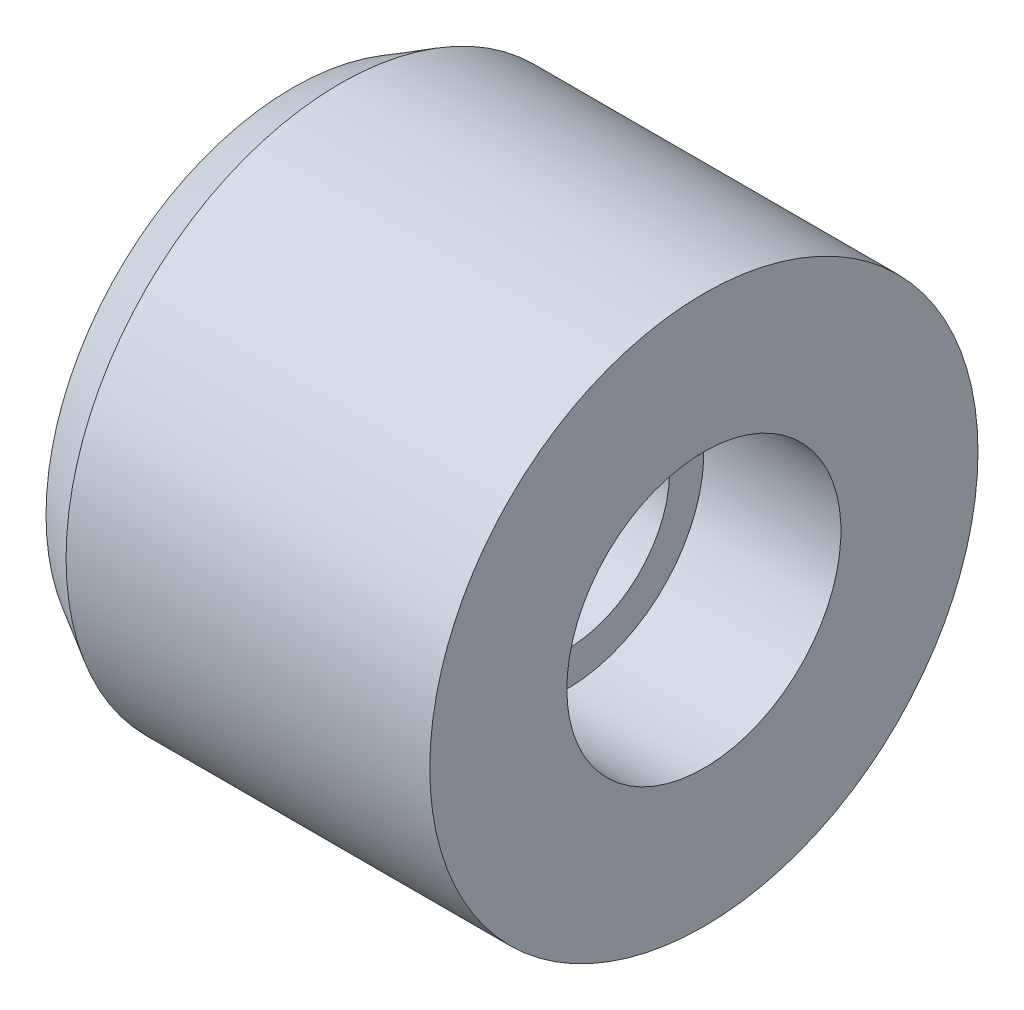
from build123d import *


with BuildPart() as part:
    # Esquisse1 → R_volution1 (revolve)
    with BuildSketch(Plane.XY, mode=Mode.PRIVATE) as r_volution1_sk:
        Polygon((0, 0), (0, 3.6), (0.692820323, 4), (6, 4), (6, 2), (4, 2), (4, 1.5), (3, 1.5), (3, 2), (1, 2), (1, 0), align=None)
    revolve(r_volution1_sk.sketch.rotate(Axis((-17.948180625, 0, 0), (1, 0, 0)), 90), axis=Axis((-17.948180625, 0, 0), (1, 0, 0)))


solid = part.part
